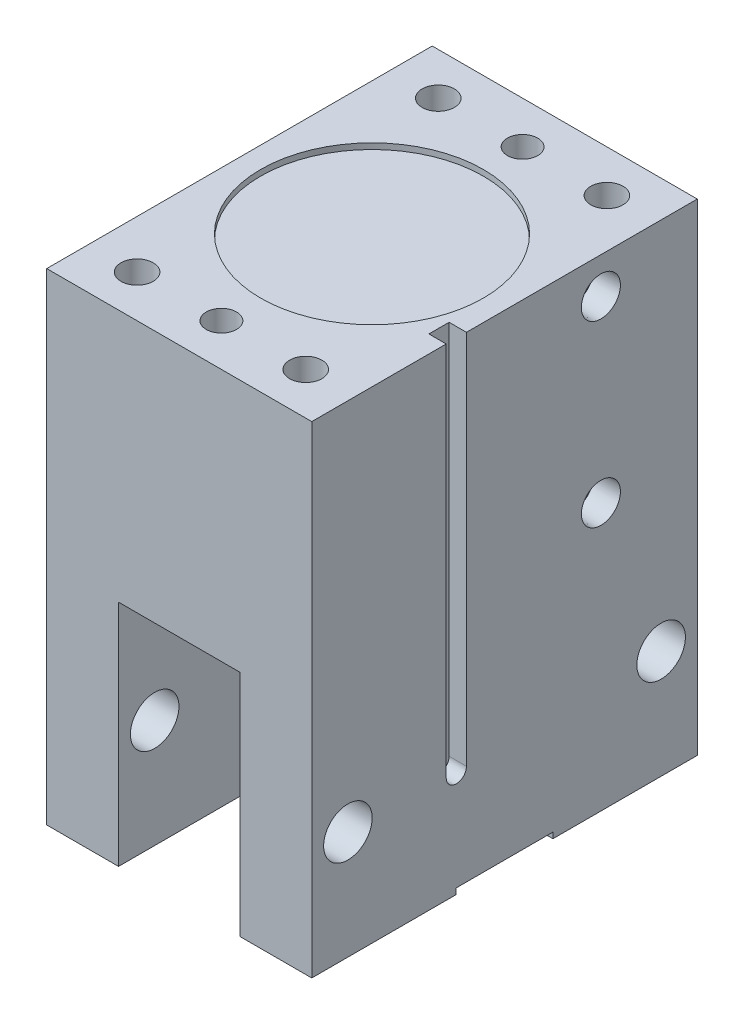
from build123d import *

# Parameters (mm, degrees)
SKETCH1_W                          = 69.85
SKETCH1_H                          = 101.6
EXTRUDE1_DEPTH                     = 63.5
M10_X_1_5_MOUNT_HOLES_D            = 8.5
M10_X_1_5_MOUNT_HOLES_DEPTH        = 20
M10_X_1_5_MOUNT_HOLES_TIP          = 2.553657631
SKETCH4_R                          = 4
F_8MM_DOWEL_HOLES_SLIP_FIT_DEPTH   = 10
SKETCH5_R                          = 29.3624
CUT_EXTRUDE2_DEPTH                 = 1.524
G1_8_TAPPED_HOLE1_AT_2_COUNT       = 2
G1_8_TAPPED_HOLE1_AT_2_PITCH       = 47.117
SKETCH9_R                          = 0.8001
CUT_EXTRUDE3_DEPTH                 = 6.35
M8_X_1_25_MOUNT_HOLES_D            = 6.8
M8_X_1_25_MOUNT_HOLES_DEPTH        = 16
M8_X_1_25_MOUNT_HOLES_TIP          = 2.042926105
SKETCH12_R                         = 4
F_8MM_DOWEL_HOLES_SLIP_FIT_2_DEPTH = 6
SKETCH13_R                         = 6.4
CUT_EXTRUDE5_DEPTH                 = 108.200338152
CUT_EXTRUDE6_DEPTH                 = 4.572
SKETCH15_W                         = 32.004
SKETCH15_H                         = 60.325
CUT_EXTRUDE7_DEPTH                 = 125.798099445
SKETCH16_W                         = 25.527
SKETCH16_H                         = 1.524
CUT_EXTRUDE8_DEPTH                 = 108.200338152
M8X1_25_TAPPED_HOLE1_D             = 6.8
M8X1_25_TAPPED_HOLE1_DEPTH         = 23
M8X1_25_TAPPED_HOLE1_TIP           = 2.042926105


with BuildPart() as part:
    # Sketch1 → Extrude1 (new, symmetric)
    with BuildSketch(Plane(origin=(0, 0, 0), x_dir=(1, 0, 0), z_dir=(0, 1, 0))):
        Rectangle(SKETCH1_W, SKETCH1_H)
    extrude(amount=EXTRUDE1_DEPTH, both=True)

    # M10 X 1.5 _Mount Holes
    with Locations(Plane(origin=(0, 63.5, 0), x_dir=(-1, 0, 0), z_dir=(0, 1, 0))):
        with Locations((-22.225, -39.6875), (-22.225, 39.6875), (22.225, 39.6875), (22.225, -39.6875)):
            Hole(M10_X_1_5_MOUNT_HOLES_D / 2, depth=M10_X_1_5_MOUNT_HOLES_DEPTH)
            with Locations((0, 0, -(M10_X_1_5_MOUNT_HOLES_DEPTH + M10_X_1_5_MOUNT_HOLES_TIP / 2))):  # 118° drill point
                Cone(0, M10_X_1_5_MOUNT_HOLES_D / 2, M10_X_1_5_MOUNT_HOLES_TIP, mode=Mode.SUBTRACT)

    # Sketch4 → 8MM Dowel Holes - Slip Fit (cut)
    with BuildSketch(Plane(origin=(0, 63.5, 0), x_dir=(-1, 0, 0), z_dir=(0, 1, 0))):
        with Locations(Location((0, 39.6875, 0), (0, 0, 90))):
            Circle(SKETCH4_R)
        with Locations(Location((0, -39.6875, 0), (0, 0, 90))):
            Circle(SKETCH4_R)
    extrude(amount=-F_8MM_DOWEL_HOLES_SLIP_FIT_DEPTH, mode=Mode.SUBTRACT)

    # Sketch5 → Cut-Extrude2 (cut)
    with BuildSketch(Plane(origin=(0, 63.5, 0), x_dir=(-1, 0, 0), z_dir=(0, 1, 0))):
        with Locations(Location((0, 0, 0), (0, 0, 90))):
            Circle(SKETCH5_R)
    extrude(amount=-CUT_EXTRUDE2_DEPTH, mode=Mode.SUBTRACT)

    # Sketch7 → G1_8 Tapped Hole1 (revolve, cut)
    with BuildSketch(Plane(origin=(34.925, 53.975, -25.4), x_dir=(0, 0, -1), z_dir=(0, 1, 0))):
        Polygon((0, 0), (0, 12.7), (4.199999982, 12.7), (4.199999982, 6.92399), (4.936186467, 6.92399), (5.1435, 0), align=None)
    g1_8_tapped_hole1 = revolve(axis=Axis((41.275, 53.975, -25.4), (-1, 0, 0)), mode=Mode.SUBTRACT)

    # G1_8 Tapped Hole1 at 2: G1_8 Tapped Hole1 ×2
    with Locations(*[(0, -i * G1_8_TAPPED_HOLE1_AT_2_PITCH, 0) for i in range(1, G1_8_TAPPED_HOLE1_AT_2_COUNT)]):
        add(g1_8_tapped_hole1, mode=Mode.SUBTRACT)

    # Sketch9 → Cut-Extrude3 (cut)
    with BuildSketch(Plane(origin=(22.225, 0, 0), x_dir=(0, 0, -1), z_dir=(1, 0, 0))):
        with Locations((25.4, 53.975)):
            Circle(SKETCH9_R)
        with Locations((25.4, 6.858)):
            Circle(SKETCH9_R)
    extrude(amount=-CUT_EXTRUDE3_DEPTH, mode=Mode.SUBTRACT)

    # M8 X 1.25 _Mount Holes
    with Locations(Plane.ZY.offset(34.925)):
        with Locations((-41.275, 33.02), (41.275, 33.02), (41.275, 7.62), (-41.275, 7.62)):
            Hole(M8_X_1_25_MOUNT_HOLES_D / 2, depth=M8_X_1_25_MOUNT_HOLES_DEPTH)
            with Locations((0, 0, -(M8_X_1_25_MOUNT_HOLES_DEPTH + M8_X_1_25_MOUNT_HOLES_TIP / 2))):  # 118° drill point
                Cone(0, M8_X_1_25_MOUNT_HOLES_D / 2, M8_X_1_25_MOUNT_HOLES_TIP, mode=Mode.SUBTRACT)

    # Sketch12 → 8MM Dowel Holes - Slip Fit 2 (cut)
    with BuildSketch(Plane.ZY.offset(34.925)):
        with Locations((-41.275, 20.32)):
            Circle(SKETCH12_R)
        with Locations((41.275, 20.32)):
            Circle(SKETCH12_R)
    extrude(amount=-F_8MM_DOWEL_HOLES_SLIP_FIT_2_DEPTH, mode=Mode.SUBTRACT)

    # Sketch13 → Cut-Extrude5 (cut, through all)
    with BuildSketch(Plane(origin=(34.925, 0, 0), x_dir=(0, 0, -1), z_dir=(1, 0, 0))):
        with Locations((41.275, -34.925)):
            Circle(SKETCH13_R)
        with Locations((-41.275, -34.925)):
            Circle(SKETCH13_R)
    extrude(amount=-CUT_EXTRUDE5_DEPTH, mode=Mode.SUBTRACT)

    # Sketch14 → Cut-Extrude6 (cut)
    with BuildSketch(Plane(origin=(34.925, 0, 0), x_dir=(0, 0, -1), z_dir=(1, 0, 0))):
        with BuildLine():
            Line((-10.033, -35.56), (-10.033, 63.5))
            Line((-10.033, 63.5), (-15.367, 63.5))
            Line((-15.367, 63.5), (-15.367, -35.56))
            ThreePointArc((-15.367, -35.56), (-12.7, -38.227), (-10.033, -35.56))
        make_face()
    extrude(amount=-CUT_EXTRUDE6_DEPTH, mode=Mode.SUBTRACT)

    # Sketch15 → Cut-Extrude7 (cut, through all)
    with BuildSketch(Plane.XY.offset(50.8)):
        with Locations((0, -33.3375)):
            Rectangle(SKETCH15_W, SKETCH15_H)
    extrude(amount=-CUT_EXTRUDE7_DEPTH, mode=Mode.SUBTRACT)

    # Sketch16 → Cut-Extrude8 (cut, through all)
    with BuildSketch(Plane(origin=(34.925, 0, 0), x_dir=(0, 0, -1), z_dir=(1, 0, 0))):
        with Locations((0, -62.738)):
            Rectangle(SKETCH16_W, SKETCH16_H)
    extrude(amount=-CUT_EXTRUDE8_DEPTH, mode=Mode.SUBTRACT)

    # M8x1.25 Tapped Hole1
    with Locations(Plane.XZ.offset(61.976)):
        with Locations((28.575, 0), (-28.575, 0)):
            Hole(M8X1_25_TAPPED_HOLE1_D / 2, depth=M8X1_25_TAPPED_HOLE1_DEPTH)
            with Locations((0, 0, -(M8X1_25_TAPPED_HOLE1_DEPTH + M8X1_25_TAPPED_HOLE1_TIP / 2))):  # 118° drill point
                Cone(0, M8X1_25_TAPPED_HOLE1_D / 2, M8X1_25_TAPPED_HOLE1_TIP, mode=Mode.SUBTRACT)


solid = part.part
